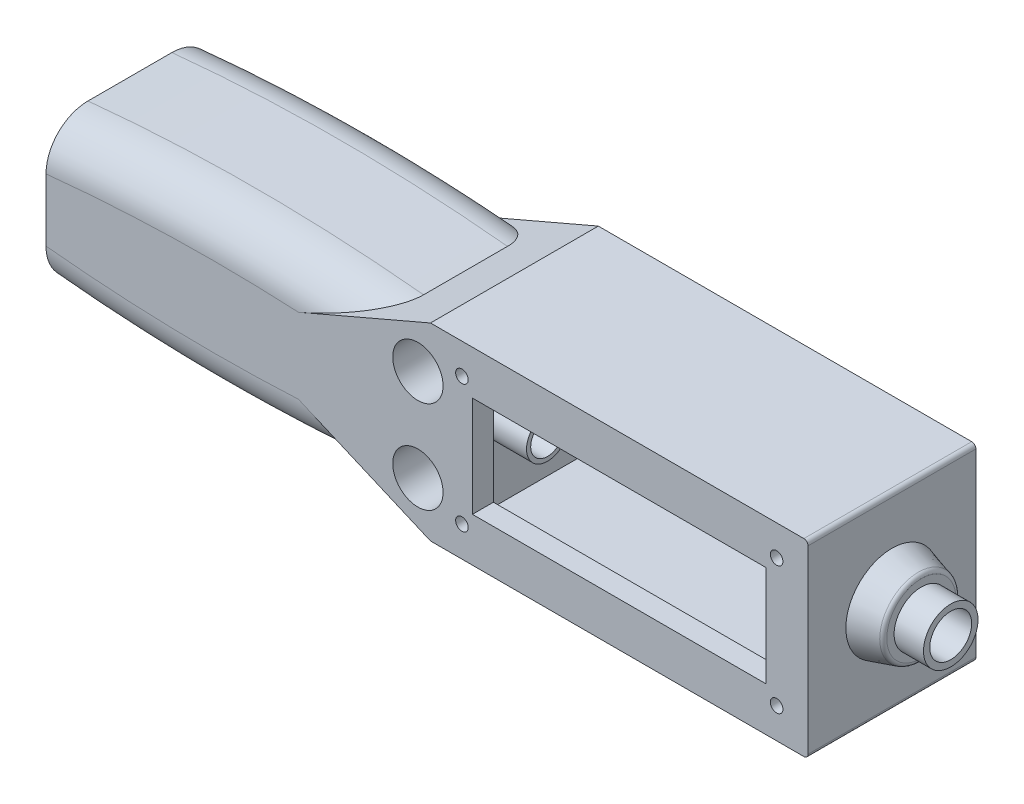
from build123d import *

# Parameters (mm, degrees)
CROQUIS1_R                   = 1.5
CROQUIS1_W                   = 70
CROQUIS1_H                   = 24
SALIENTE_EXTRUIR1_DEPTH      = 35
SALIENTE_EXTRUIR2_DEPTH      = 5
SALIENTE_EXTRUIR3_DEPTH      = 40
REDONDEO3_R                  = 10
REDONDEO4_R                  = 10
REDONDEO8_R                  = 10
REDONDEO9_R                  = 10
CORTAR_EXTRUIR2_DEPTH        = 30
CORTAR_EXTRUIR2_DEPTH_BACK   = 20
CROQUIS12_W                  = 80
CROQUIS12_H                  = 36
SALIENTE_EXTRUIR7_DEPTH      = 2.5
SALIENTE_EXTRUIR7_DEPTH_BACK = 5
CROQUIS13_W                  = 80
CROQUIS13_H                  = 36
CROQUIS16_R                  = 11
SALIENTE_EXTRUIR8_DEPTH      = 7
SALIENTE_EXTRUIR8_TAPER      = 16
REDONDEO12_R                 = 1
CROQUIS27_R                  = 6.5
CROQUIS27_R_2                = 5
SALIENTE_EXTRUIR12_DEPTH     = 7
CORTAR_EXTRUIR12_START       = -25
CROQUIS28_R                  = 5
CORTAR_EXTRUIR12_DEPTH       = 25
CROQUIS29_R                  = 5
CROQUIS29_R_2                = 4
SALIENTE_EXTRUIR13_DEPTH     = 10
CROQUIS30_R                  = 5
CORTAR_EXTRUIR14_DEPTH       = 12
CORTAR_EXTRUIR15_DEPTH       = 201.013151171
CORTAR_EXTRUIR15_DEPTH_BACK  = 105
CROQUIS31_R                  = 4
CROQUIS32_R                  = 5
CROQUIS32_R_2                = 4
SALIENTE_EXTRUIR14_DEPTH     = 10
REDONDEO13_R                 = 1
CROQUIS33_R                  = 6
CORTAR_EXTRUIR17_DEPTH       = 30


with BuildPart() as part:
    # Croquis1 → Saliente-Extruir1 (new body)
    with BuildSketch(Plane.XY):
        Polygon((-45, 22.5), (-56.6374469, 17.5), (-56.6374469, -17.5), (-45, -22.5), (45, -22.5), (45, 22.5), align=None)
        with Locations((-37.5, 15.25)):
            Circle(CROQUIS1_R, mode=Mode.SUBTRACT)
        with Locations((37.5, 15.25)):
            Circle(CROQUIS1_R, mode=Mode.SUBTRACT)
        with Locations((-37.5, -15.25)):
            Circle(CROQUIS1_R, mode=Mode.SUBTRACT)
        with Locations((37.5, -15.25)):
            Circle(CROQUIS1_R, mode=Mode.SUBTRACT)
        Rectangle(CROQUIS1_W, CROQUIS1_H, mode=Mode.SUBTRACT)
    extrude(amount=SALIENTE_EXTRUIR1_DEPTH)

    # Croquis3 → Saliente-Extruir2 (add)
    with BuildSketch(Plane(origin=(0, 0, 0), x_dir=(-1, 0, 0), z_dir=(0, 0, -1))):
        Polygon((56.6374469, 17.5), (45, 22.5), (-45, 22.5), (-45, -22.5), (45, -22.5), (56.6374469, -17.5), align=None)
    extrude(amount=SALIENTE_EXTRUIR2_DEPTH)

    # Croquis6 → Saliente-Extruir3 (add, through all)
    with BuildSketch(Plane.XY.offset(35)):
        with BuildLine():
            Line((-136.6374469, 17.5), (-136.6374469, -17.5))
            ThreePointArc((-136.6374469, -17.5), (-96.6374469, -19.505025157), (-56.6374469, -17.5))
            Line((-56.6374469, -17.5), (-56.6374469, 17.5))
            ThreePointArc((-56.6374469, 17.5), (-96.6374469, 19.505025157), (-136.6374469, 17.5))
        make_face()
    extrude(amount=-SALIENTE_EXTRUIR3_DEPTH)

    # Redondeo3
    redondeo3_edges = [part.edges().sort_by_distance(p)[0] for p in [
        (-96.6374469, 19.505025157, -5),
    ]]
    fillet(redondeo3_edges, radius=REDONDEO3_R)

    # Redondeo4
    redondeo4_edges = [part.edges().sort_by_distance(p)[0] for p in [
        (-96.6374469, -19.505025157, -5),
    ]]
    fillet(redondeo4_edges, radius=REDONDEO4_R)

    # Redondeo8
    redondeo8_edges = [part.edges().sort_by_distance(p)[0] for p in [
        (-96.6374469, 19.505025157, 35),
    ]]
    fillet(redondeo8_edges, radius=REDONDEO8_R)

    # Redondeo9
    redondeo9_edges = [part.edges().sort_by_distance(p)[0] for p in [
        (-96.6374469, -19.505025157, 35),
    ]]
    fillet(redondeo9_edges, radius=REDONDEO9_R)

    # Croquis12 → Cortar-Extruir2 (cut, two sides: drawn at the far end of the back side and taken through both)
    with BuildSketch(Plane.XY.offset(-CORTAR_EXTRUIR2_DEPTH_BACK)):
        Rectangle(CROQUIS12_W, CROQUIS12_H)
    extrude(amount=CORTAR_EXTRUIR2_DEPTH + CORTAR_EXTRUIR2_DEPTH_BACK, mode=Mode.SUBTRACT)

    # Croquis13 → Saliente-Extruir7 (add, two sides: drawn at the far end of the back side and taken through both)
    with BuildSketch(Plane.XY.offset(-SALIENTE_EXTRUIR7_DEPTH_BACK)):
        Rectangle(CROQUIS13_W, CROQUIS13_H)
    extrude(amount=SALIENTE_EXTRUIR7_DEPTH + SALIENTE_EXTRUIR7_DEPTH_BACK)

    # Croquis16 → Saliente-Extruir8 (add)
    with BuildSketch(Plane(origin=(45, 0, 0), x_dir=(0, 0, -1), z_dir=(1, 0, 0))):
        with Locations((-15, 0)):
            Circle(CROQUIS16_R)
    extrude(amount=SALIENTE_EXTRUIR8_DEPTH, taper=SALIENTE_EXTRUIR8_TAPER)

    # Redondeo12
    redondeo12_edges = [part.edges().sort_by_distance(p)[0] for p in [
        (52, 0, 23.9927823),
    ]]
    fillet(redondeo12_edges, radius=REDONDEO12_R)

    # Croquis27 → Saliente-Extruir12 (add)
    with BuildSketch(Plane(origin=(52, 0, 0), x_dir=(0, 0, -1), z_dir=(1, 0, 0))):
        with Locations((-15, 0)):
            Circle(CROQUIS27_R)
        with Locations((-15, 0)):
            Circle(CROQUIS27_R_2, mode=Mode.SUBTRACT)
    extrude(amount=SALIENTE_EXTRUIR12_DEPTH)

    # Croquis28 → Cortar-Extruir12 (cut)
    with BuildSketch(Plane(origin=(52, 0, 0), x_dir=(0, 0, -1), z_dir=(1, 0, 0)).offset(CORTAR_EXTRUIR12_START)):
        with Locations((-15, 0)):
            Circle(CROQUIS28_R)
    extrude(amount=CORTAR_EXTRUIR12_DEPTH, mode=Mode.SUBTRACT)

    # Croquis30 → Cortar-Extruir14 (cut)
    with BuildSketch(Plane.ZY.offset(136.6374469)):
        with BuildLine():
            ThreePointArc((0, 5.5), (0.585786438, 6.914213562), (2, 7.5))
            Line((2, 7.5), (28, 7.5))
            ThreePointArc((28, 7.5), (29.414213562, 6.914213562), (30, 5.5))
            Line((30, 5.5), (30, -5.5))
            ThreePointArc((30, -5.5), (29.414213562, -6.914213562), (28, -7.5))
            Line((28, -7.5), (2, -7.5))
            ThreePointArc((2, -7.5), (0.585786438, -6.914213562), (0, -5.5))
            Line((0, -5.5), (0, 5.5))
        make_face()
        with Locations(Location((7.89, 0, 0), (0, 0, 270))):
            Circle(CROQUIS30_R, mode=Mode.SUBTRACT)
        with Locations(Location((22.11, 0, 0), (0, 0, 270))):
            Circle(CROQUIS30_R, mode=Mode.SUBTRACT)
    extrude(amount=-CORTAR_EXTRUIR14_DEPTH, mode=Mode.SUBTRACT)

    # Croquis31 → Cortar-Extruir15 (cut, two sides: drawn at the far end of the back side and taken through both)
    with BuildSketch(Plane.ZY.offset(136.6374469).offset(-CORTAR_EXTRUIR15_DEPTH_BACK)):
        with Locations(Location((22.11, 0, 0), (0, 0, 90))):
            Circle(CROQUIS31_R)
        with Locations(Location((7.89, 0, 0), (0, 0, 90))):
            Circle(CROQUIS31_R)
    extrude(amount=CORTAR_EXTRUIR15_DEPTH + CORTAR_EXTRUIR15_DEPTH_BACK, mode=Mode.SUBTRACT)

    # Croquis32 → Saliente-Extruir14 (add)
    # profile 1 of 2: a face of its own
    with BuildSketch(Plane(origin=(-40, 0, 0), x_dir=(0, 0, -1), z_dir=(1, 0, 0))):
        with Locations(Location((-7.89, 0, 0), (0, 0, 270))):
            Circle(CROQUIS32_R)
        with Locations(Location((-7.89, 0, 0), (0, 0, 90))):
            Circle(CROQUIS32_R_2, mode=Mode.SUBTRACT)
    # profile 2 of 2: a face of its own
    with BuildSketch(Plane(origin=(-40, 0, 0), x_dir=(0, 0, -1), z_dir=(1, 0, 0))):
        with Locations(Location((-22.11, 0, 0), (0, 0, 270))):
            Circle(CROQUIS32_R)
        with Locations(Location((-22.11, 0, 0), (0, 0, 90))):
            Circle(CROQUIS32_R_2, mode=Mode.SUBTRACT)
    extrude(amount=SALIENTE_EXTRUIR14_DEPTH)

    # Redondeo13
    redondeo13_edges = [part.edges().sort_by_distance(p)[0] for p in [
        (45, 22.5, 15),
        (45, -22.5, 15),
    ]]
    fillet(redondeo13_edges, radius=REDONDEO13_R)

    # Croquis33 → Cortar-Extruir17 (cut)
    with BuildSketch(Plane.XY.offset(35)):
        with Locations((-48, -11)):
            Circle(CROQUIS33_R)
        with Locations((-48, 11)):
            Circle(CROQUIS33_R)
    extrude(amount=-CORTAR_EXTRUIR17_DEPTH, mode=Mode.SUBTRACT)


with BuildPart() as body_2:
    # Croquis29 → Saliente-Extruir13 (new body)
    with BuildSketch(Plane.ZY.offset(-40)):
        with Locations((15, 0)):
            Circle(CROQUIS29_R)
        with Locations((15, 0)):
            Circle(CROQUIS29_R_2, mode=Mode.SUBTRACT)
    extrude(amount=SALIENTE_EXTRUIR13_DEPTH)


solid = Compound([part.part, body_2.part])
